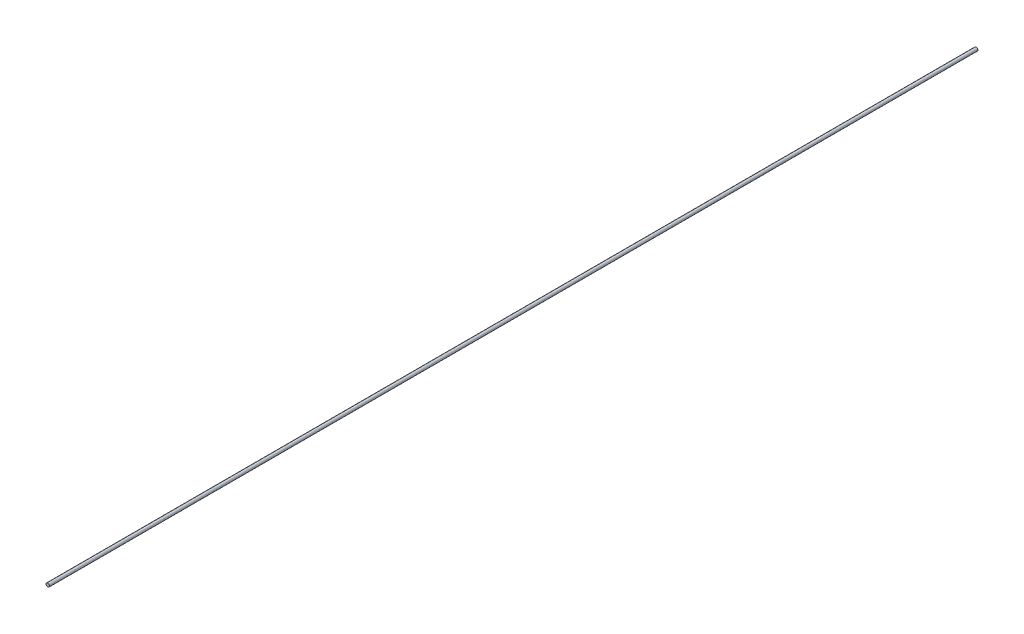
ISO-10303-21;
HEADER;
FILE_DESCRIPTION(('STEP AP214'),'2;1');
FILE_NAME('part.step','',(''),(''),'','','');
FILE_SCHEMA(('AUTOMOTIVE_DESIGN { 1 0 10303 214 1 1 1 1 }'));
ENDSEC;
DATA;
#1=APPLICATION_CONTEXT('core data for automotive mechanical design processes');
#2=APPLICATION_PROTOCOL_DEFINITION('international standard','automotive_design',2000,#1);
#3=PRODUCT_CONTEXT('',#1,'mechanical');
#4=PRODUCT('Part','Part','',(#3));
#5=PRODUCT_RELATED_PRODUCT_CATEGORY('part','',(#4));
#6=PRODUCT_DEFINITION_FORMATION('','',#4);
#7=PRODUCT_DEFINITION_CONTEXT('part definition',#1,'design');
#8=PRODUCT_DEFINITION('design','',#6,#7);
#9=PRODUCT_DEFINITION_SHAPE('','',#8);
#10=(LENGTH_UNIT() NAMED_UNIT(*) SI_UNIT(.MILLI.,.METRE.));
#11=(NAMED_UNIT(*) PLANE_ANGLE_UNIT() SI_UNIT($,.RADIAN.));
#12=(NAMED_UNIT(*) SI_UNIT($,.STERADIAN.) SOLID_ANGLE_UNIT());
#13=UNCERTAINTY_MEASURE_WITH_UNIT(LENGTH_MEASURE(1.E-05),#10,'distance_accuracy_value','');
#14=(GEOMETRIC_REPRESENTATION_CONTEXT(3) GLOBAL_UNCERTAINTY_ASSIGNED_CONTEXT((#13)) GLOBAL_UNIT_ASSIGNED_CONTEXT((#10,
#11,#12)) REPRESENTATION_CONTEXT('',''));
#15=CARTESIAN_POINT('',(0.,0.,0.));
#16=DIRECTION('',(0.,0.,1.));
#17=DIRECTION('',(1.,0.,0.));
#18=AXIS2_PLACEMENT_3D('',#15,#16,#17);
#19=CARTESIAN_POINT('',(0.,0.,1066.8));
#20=DIRECTION('',(0.,0.,-1.));
#21=DIRECTION('',(-1.,0.,0.));
#22=AXIS2_PLACEMENT_3D('',#19,#20,#21);
#23=CYLINDRICAL_SURFACE('',#22,1.9812);
#24=CARTESIAN_POINT('',(0.,0.,1066.8));
#25=DIRECTION('',(0.,0.,1.));
#26=DIRECTION('',(1.,0.,0.));
#27=AXIS2_PLACEMENT_3D('',#24,#25,#26);
#28=CIRCLE('',#27,1.9812);
#29=CARTESIAN_POINT('',(1.9812,0.,1066.8));
#30=VERTEX_POINT('',#29);
#31=EDGE_CURVE('E10',#30,#30,#28,.T.);
#32=ORIENTED_EDGE('',*,*,#31,.F.);
#33=EDGE_LOOP('',(#32));
#34=FACE_BOUND('',#33,.T.);
#35=CARTESIAN_POINT('',(0.,0.,0.));
#36=DIRECTION('',(0.,0.,1.));
#37=DIRECTION('',(1.,0.,0.));
#38=AXIS2_PLACEMENT_3D('',#35,#36,#37);
#39=CIRCLE('',#38,1.9812);
#40=CARTESIAN_POINT('',(1.9812,0.,0.));
#41=VERTEX_POINT('',#40);
#42=EDGE_CURVE('E44',#41,#41,#39,.T.);
#43=ORIENTED_EDGE('',*,*,#42,.T.);
#44=EDGE_LOOP('',(#43));
#45=FACE_BOUND('',#44,.T.);
#46=ADVANCED_FACE('F41',(#34,#45),#23,.T.);
#47=CARTESIAN_POINT('',(0.,0.,1066.8));
#48=DIRECTION('',(0.,0.,1.));
#49=DIRECTION('',(1.,0.,0.));
#50=AXIS2_PLACEMENT_3D('',#47,#48,#49);
#51=PLANE('',#50);
#52=ORIENTED_EDGE('',*,*,#31,.T.);
#53=EDGE_LOOP('',(#52));
#54=FACE_BOUND('',#53,.T.);
#55=ADVANCED_FACE('F56',(#54),#51,.T.);
#56=CARTESIAN_POINT('',(0.,0.,0.));
#57=DIRECTION('',(0.,0.,1.));
#58=DIRECTION('',(1.,0.,0.));
#59=AXIS2_PLACEMENT_3D('',#56,#57,#58);
#60=PLANE('',#59);
#61=ORIENTED_EDGE('',*,*,#42,.F.);
#62=EDGE_LOOP('',(#61));
#63=FACE_BOUND('',#62,.T.);
#64=ADVANCED_FACE('F54',(#63),#60,.F.);
#65=CLOSED_SHELL('',(#46,#55,#64));
#66=MANIFOLD_SOLID_BREP('B2',#65);
#67=ADVANCED_BREP_SHAPE_REPRESENTATION('',(#18,#66),#14);
#68=SHAPE_DEFINITION_REPRESENTATION(#9,#67);
ENDSEC;
END-ISO-10303-21;
